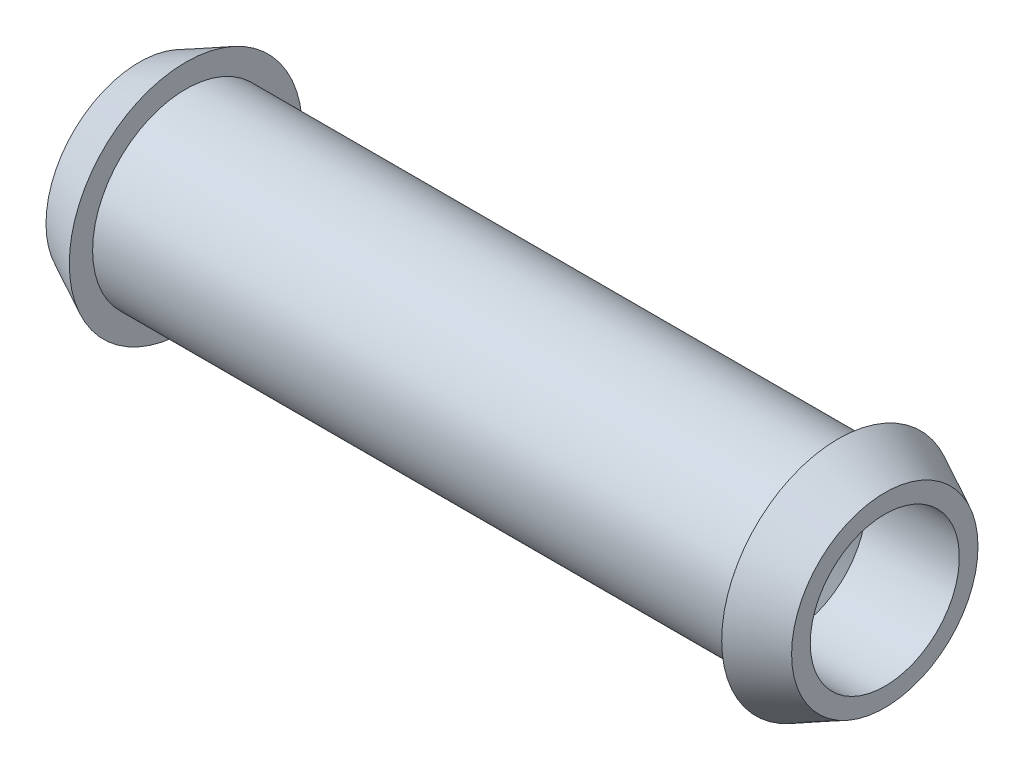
from build123d import *

# Parameters (mm, degrees)
SKETCH1_W = 40
SKETCH1_H = 5
SKETCH2_W = 3.5
SKETCH2_H = 6


with BuildPart() as part:
    # Sketch1 → Base-Revolve (revolve)
    with BuildSketch(Plane.XY, mode=Mode.PRIVATE) as base_revolve_sk:
        with Locations((0, 2.5)):
            Rectangle(SKETCH1_W, SKETCH1_H)
    revolve(base_revolve_sk.sketch.rotate(Axis((-30, 0, 0), (1, 0, 0)), 90), axis=Axis((-30, 0, 0), (1, 0, 0)))

    # Sketch2 → Cut-to-GripLength (revolve, cut)
    with BuildSketch(Plane.XY):
        with Locations((-19.25, 3)):
            Rectangle(SKETCH2_W, SKETCH2_H)
        with Locations((19.25, 3)):
            Rectangle(SKETCH2_W, SKETCH2_H)
    revolve(axis=Axis((-30, 0, 0), (1, 0, 0)), mode=Mode.SUBTRACT)

    # Sketch3 → HeadTypeA (revolve)
    with BuildSketch(Plane.XY, mode=Mode.PRIVATE) as headtypea_sk:
        Polygon((-20, 5), (-20, 0), (-17.5, 0), (-17.5, 6.25), align=None)
        Polygon((20, 5), (17.5, 6.25), (17.5, 0), (20, 0), align=None)
    revolve(headtypea_sk.sketch.rotate(Axis((-23, 0, 0), (1, 0, 0)), 90), axis=Axis((-23, 0, 0), (1, 0, 0)))

    # Sketch5 → HoleTypeA (revolve, cut)
    with BuildSketch(Plane.XY, mode=Mode.PRIVATE) as holetypea_sk:
        Polygon((-12.690598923, 0), (-15, 4), (-20, 4), (-20, 0), align=None)
        Polygon((12.690598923, 0), (15, 4), (20, 4), (20, 0), align=None)
    revolve(holetypea_sk.sketch.rotate(Axis((-22, 0, 0), (1, 0, 0)), 90), axis=Axis((-22, 0, 0), (1, 0, 0)), mode=Mode.SUBTRACT)


solid = part.part
